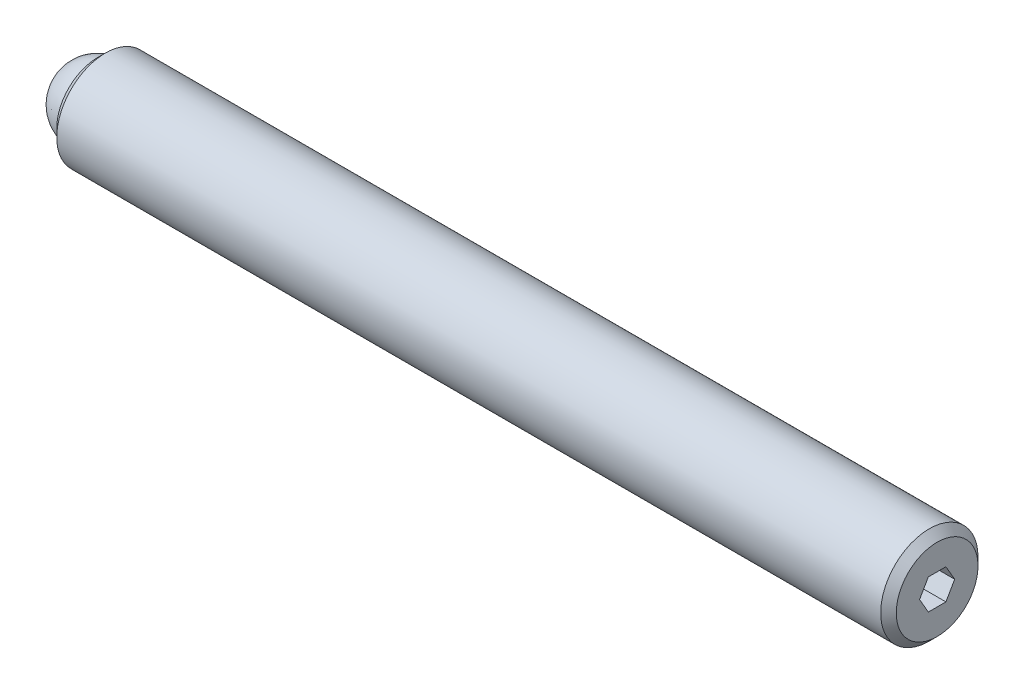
from build123d import *

# Parameters (mm, degrees)
SKETCH2_R           = 3.175
BOSS_EXTRUDE1_DEPTH = 54.76875
CHAMFER1_SIZE       = 0.508
CHAMFER2_SIZE       = 0.508
CUT_EXTRUDE2_DEPTH  = 2.286
SKETCH3_R           = 2.38125
CUT_EXTRUDE3_DEPTH  = 1.984375


with BuildPart() as part:
    # Sketch2 → Boss-Extrude1 (new body)
    with BuildSketch(Plane(origin=(0, 0, 0), x_dir=(0, 0, -1), z_dir=(1, 0, 0))):
        Circle(SKETCH2_R)
    extrude(amount=BOSS_EXTRUDE1_DEPTH)

    # Chamfer1
    chamfer1_edges = [part.edges().sort_by_distance(p)[0] for p in [
        (0, 0, 3.175),
    ]]
    chamfer(chamfer1_edges, length=CHAMFER1_SIZE)

    # Chamfer2
    chamfer2_edges = [part.edges().sort_by_distance(p)[0] for p in [
        (54.76875, 0, 3.175),
    ]]
    chamfer(chamfer2_edges, length=CHAMFER2_SIZE)

    # Sketch4 → Cut-Extrude2 (cut)
    with BuildSketch(Plane(origin=(54.76875, 0, 0), x_dir=(0, 0, -1), z_dir=(1, 0, 0))):
        Polygon((1.14567944, 0), (0.57283972, 0.9921875), (-0.57283972, 0.9921875), (-1.14567944, 0), (-0.57283972, -0.9921875), (0.57283972, -0.9921875), align=None)
    extrude(amount=-CUT_EXTRUDE2_DEPTH, mode=Mode.SUBTRACT)

    # Sketch3 → Cut-Extrude3 (cut)
    with BuildSketch(Plane.ZY):
        Circle(SKETCH3_R)
    extrude(amount=-CUT_EXTRUDE3_DEPTH, mode=Mode.SUBTRACT)


with BuildPart() as body_2:
    # Sketch5 → Revolve1 (revolve)
    with BuildSketch(Plane.ZY):
        with BuildLine():
            Line((0, 0), (0, -2.38125))
            ThreePointArc((0, -2.38125), (-2.38125, 0), (0, 2.38125))
            Line((0, 2.38125), (0, 0))
        make_face()
    revolve(axis=Axis((0, 0, 0), (0, 1, 0)))


solid = Compound([part.part, body_2.part])
